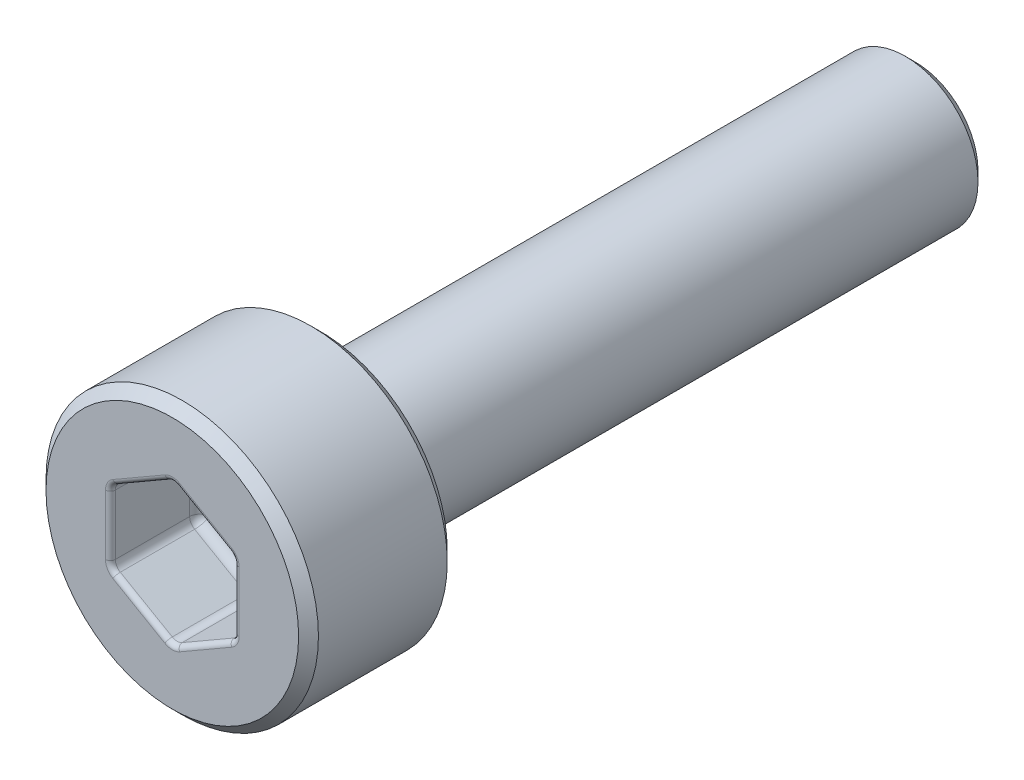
from build123d import *

# Parameters (mm, degrees)
SCHNITT_LINEAR_AUSTRAGEN1_DEPTH = 1.8
FASE1_SIZE                      = 0.2
VERRUNDUNG1_R                   = 0.2
VERRUNDUNG2_R                   = 0.1


with BuildPart() as part:
    # Skizze1 → Rotation1 (revolve)
    with BuildSketch(Plane(origin=(0, 0, 0), x_dir=(0, 0, -1), z_dir=(1, 0, 0)), mode=Mode.PRIVATE) as rotation1_sk:
        Polygon((-3, 0), (-3, 2.75), (0, 2.75), (0, 1.465), (12, 1.465), (12, 0), align=None)
    revolve(rotation1_sk.sketch.rotate(Axis((0, 0, 21.919879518), (0, 0, -1)), 90), axis=Axis((0, 0, 21.919879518), (0, 0, -1)))

    # Skizze2 → Schnitt-Linear austragen1 (cut)
    with BuildSketch(Plane.XY.offset(3)):
        Polygon((1.25, -0.721687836), (1.25, 0.721687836), (0, 1.443375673), (-1.25, 0.721687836), (-1.25, -0.721687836), (0, -1.443375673), align=None)
    extrude(amount=-SCHNITT_LINEAR_AUSTRAGEN1_DEPTH, mode=Mode.SUBTRACT)

    # Fase1
    fase1_edges = [part.edges().sort_by_distance(p)[0] for p in [
        (-1.465, 0, -12),
        (-2.75, 0, 0),
        (-2.75, 0, 3),
    ]]
    chamfer(fase1_edges, length=FASE1_SIZE)

    # Verrundung1
    verrundung1_edges = [part.edges().sort_by_distance(p)[0] for p in [
        (0.625, -1.082531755, 1.2),
        (1.25, -0.721687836, 2.1),
        (-0.625, -1.082531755, 1.2),
        (0, -1.443375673, 2.1),
        (-1.25, 0, 1.2),
        (-1.25, -0.721687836, 2.1),
        (-0.625, 1.082531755, 1.2),
        (-1.25, 0.721687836, 2.1),
        (0.625, 1.082531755, 1.2),
        (0, 1.443375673, 2.1),
        (1.25, 0, 1.2),
        (1.25, 0.721687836, 2.1),
        (-1.465, 0, 0),
    ]]
    fillet(verrundung1_edges, radius=VERRUNDUNG1_R)

    # Verrundung2
    verrundung2_edges = [part.edges().sort_by_distance(p)[0] for p in [
        (-0.625, -1.082531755, 3),
        (-1.25, 0, 3),
        (-0.625, 1.082531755, 3),
        (0.625, 1.082531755, 3),
        (1.25, 0, 3),
        (0.625, -1.082531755, 3),
        (-1.223205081, -0.706217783, 3),
        (0, -1.412435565, 3),
        (1.223205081, -0.706217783, 3),
        (1.223205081, 0.706217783, 3),
        (0, 1.412435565, 3),
        (-1.223205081, 0.706217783, 3),
    ]]
    fillet(verrundung2_edges, radius=VERRUNDUNG2_R)


solid = part.part
